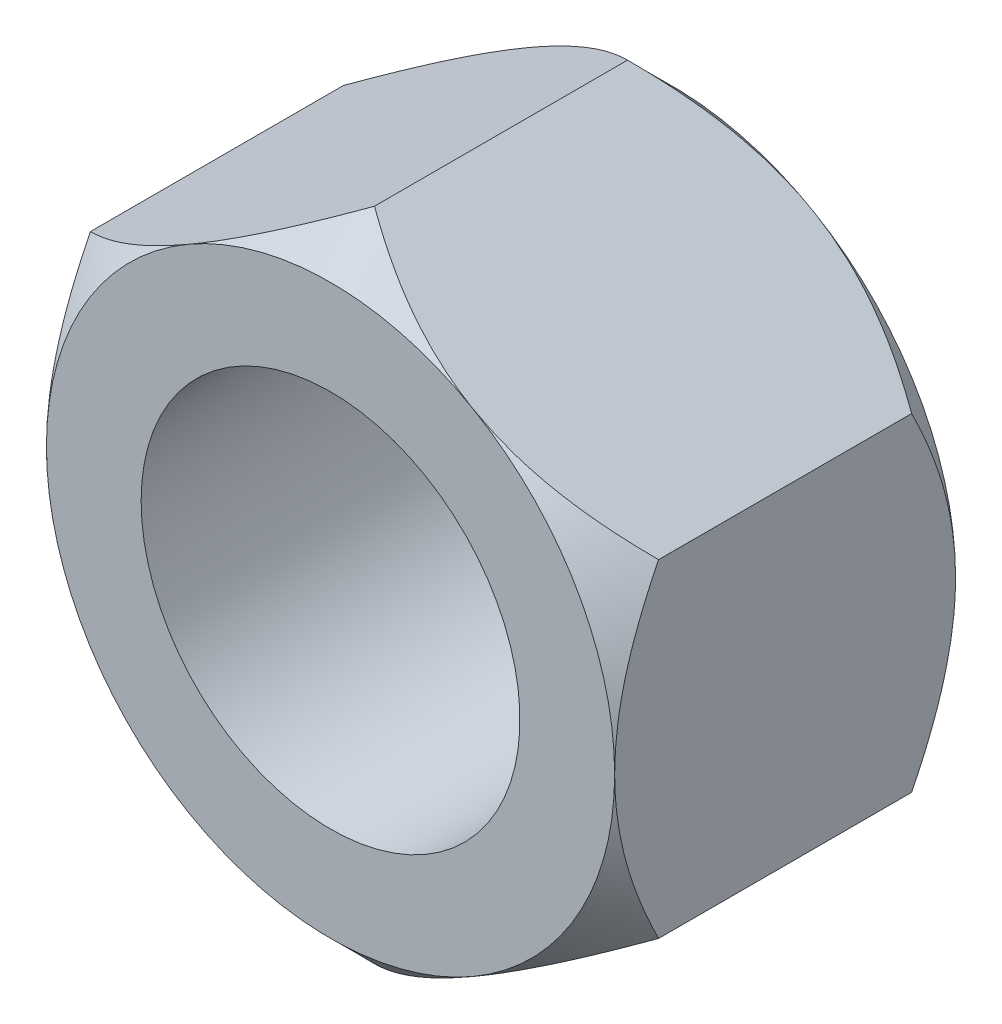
ISO-10303-21;
HEADER;
FILE_DESCRIPTION(('STEP AP214'),'2;1');
FILE_NAME('part.step','',(''),(''),'','','');
FILE_SCHEMA(('AUTOMOTIVE_DESIGN { 1 0 10303 214 1 1 1 1 }'));
ENDSEC;
DATA;
#1=APPLICATION_CONTEXT('core data for automotive mechanical design processes');
#2=APPLICATION_PROTOCOL_DEFINITION('international standard','automotive_design',2000,#1);
#3=PRODUCT_CONTEXT('',#1,'mechanical');
#4=PRODUCT('Part','Part','',(#3));
#5=PRODUCT_RELATED_PRODUCT_CATEGORY('part','',(#4));
#6=PRODUCT_DEFINITION_FORMATION('','',#4);
#7=PRODUCT_DEFINITION_CONTEXT('part definition',#1,'design');
#8=PRODUCT_DEFINITION('design','',#6,#7);
#9=PRODUCT_DEFINITION_SHAPE('','',#8);
#10=(LENGTH_UNIT() NAMED_UNIT(*) SI_UNIT(.MILLI.,.METRE.));
#11=(NAMED_UNIT(*) PLANE_ANGLE_UNIT() SI_UNIT($,.RADIAN.));
#12=(NAMED_UNIT(*) SI_UNIT($,.STERADIAN.) SOLID_ANGLE_UNIT());
#13=UNCERTAINTY_MEASURE_WITH_UNIT(LENGTH_MEASURE(1.E-05),#10,'distance_accuracy_value','');
#14=(GEOMETRIC_REPRESENTATION_CONTEXT(3) GLOBAL_UNCERTAINTY_ASSIGNED_CONTEXT((#13)) GLOBAL_UNIT_ASSIGNED_CONTEXT((#10,
#11,#12)) REPRESENTATION_CONTEXT('',''));
#15=CARTESIAN_POINT('',(0.,0.,0.));
#16=DIRECTION('',(0.,0.,1.));
#17=DIRECTION('',(1.,0.,0.));
#18=AXIS2_PLACEMENT_3D('',#15,#16,#17);
#19=CARTESIAN_POINT('',(0.,10.3923048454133,10.8));
#20=DIRECTION('',(0.5,-0.866025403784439,0.));
#21=DIRECTION('',(0.866025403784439,0.5,0.));
#22=AXIS2_PLACEMENT_3D('',#19,#20,#21);
#23=PLANE('',#22);
#24=DIRECTION('',(0.,0.,-1.));
#25=VECTOR('',#24,1.);
#26=CARTESIAN_POINT('',(0.,10.3923048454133,10.8));
#27=LINE('',#26,#25);
#28=CARTESIAN_POINT('',(0.,10.3923048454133,9.40769515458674));
#29=VERTEX_POINT('',#28);
#30=CARTESIAN_POINT('',(0.,10.3923048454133,1.39230484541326));
#31=VERTEX_POINT('',#30);
#32=EDGE_CURVE('E199',#29,#31,#27,.T.);
#33=ORIENTED_EDGE('',*,*,#32,.T.);
#34=CARTESIAN_POINT('',(0.000200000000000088,10.3924203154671,1.39242031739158));
#35=CARTESIAN_POINT('',(-0.154531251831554,10.3030861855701,1.30309863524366));
#36=CARTESIAN_POINT('',(-0.310474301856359,10.21305242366,1.21650254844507));
#37=CARTESIAN_POINT('',(-0.624972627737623,10.0314767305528,1.04962736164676));
#38=CARTESIAN_POINT('',(-0.783529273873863,9.93993400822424,0.969351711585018));
#39=CARTESIAN_POINT('',(-1.10419129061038,9.75479970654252,0.815643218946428));
#40=CARTESIAN_POINT('',(-1.26631178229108,9.66119939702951,0.742252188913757));
#41=CARTESIAN_POINT('',(-1.59321555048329,9.47246141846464,0.603906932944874));
#42=CARTESIAN_POINT('',(-1.7579984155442,9.37732398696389,0.538951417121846));
#43=CARTESIAN_POINT('',(-2.08757746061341,9.18704143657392,0.419532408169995));
#44=CARTESIAN_POINT('',(-2.25233313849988,9.09191970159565,0.364920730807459));
#45=CARTESIAN_POINT('',(-2.58415409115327,8.90034278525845,0.266051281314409));
#46=CARTESIAN_POINT('',(-2.75121911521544,8.80388774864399,0.221792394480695));
#47=CARTESIAN_POINT('',(-3.08694416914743,8.61005679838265,0.144742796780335));
#48=CARTESIAN_POINT('',(-3.25559971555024,8.51268347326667,0.111926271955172));
#49=CARTESIAN_POINT('',(-3.59432673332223,8.31711933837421,0.0584825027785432));
#50=CARTESIAN_POINT('',(-3.76439798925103,8.2189286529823,0.0378534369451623));
#51=CARTESIAN_POINT('',(-4.17884614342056,7.97964689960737,0.00326438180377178));
#52=CARTESIAN_POINT('',(-4.42367100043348,7.83829720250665,-0.00399417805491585));
#53=CARTESIAN_POINT('',(-4.91287794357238,7.55585344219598,0.00818869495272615));
#54=CARTESIAN_POINT('',(-5.15725984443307,7.41475948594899,0.0276394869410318));
#55=CARTESIAN_POINT('',(-5.64371998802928,7.13390159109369,0.0920929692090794));
#56=CARTESIAN_POINT('',(-5.88579534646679,6.99413931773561,0.137124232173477));
#57=CARTESIAN_POINT('',(-6.36578525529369,6.7170170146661,0.250290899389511));
#58=CARTESIAN_POINT('',(-6.60370012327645,6.57965680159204,0.31842453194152));
#59=CARTESIAN_POINT('',(-7.02603245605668,6.33582311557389,0.458593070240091));
#60=CARTESIAN_POINT('',(-7.21138526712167,6.22880962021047,0.526940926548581));
#61=CARTESIAN_POINT('',(-7.57876374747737,6.01670355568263,0.674650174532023));
#62=CARTESIAN_POINT('',(-7.76078931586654,5.91161104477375,0.754011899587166));
#63=CARTESIAN_POINT('',(-8.12093998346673,5.70367795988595,0.921970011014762));
#64=CARTESIAN_POINT('',(-8.29907532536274,5.6008314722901,1.01053735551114));
#65=CARTESIAN_POINT('',(-8.65204760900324,5.39704282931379,1.19574403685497));
#66=CARTESIAN_POINT('',(-8.82688649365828,5.29609955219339,1.2923784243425));
#67=CARTESIAN_POINT('',(-9.0002,5.1960369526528,1.39242031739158));
#68=B_SPLINE_CURVE_WITH_KNOTS('',3,(#34,#35,#36,#37,#38,#39,#40,#41,#42,#43,#44,#45,#46,#47,#48,
#49,#50,#51,#52,#53,#54,#55,#56,#57,#58,#59,#60,#61,#62,#63,#64,#65,#66,#67),.UNSPECIFIED.,.F.,
.F.,(4,2,2,2,2,2,2,2,2,2,2,2,2,2,2,2,4),(0.,0.59928023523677,1.19888534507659,1.80192368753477,
2.40486970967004,2.99838724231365,3.59184084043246,4.18394681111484,4.77596426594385,
5.62301971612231,6.47037205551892,7.31867273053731,8.16690836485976,8.84061799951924,
9.5143480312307,10.1860136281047,10.8572701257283),.UNSPECIFIED.);
#69=CARTESIAN_POINT('',(-4.5,7.79422863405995,0.));
#70=VERTEX_POINT('',#69);
#71=EDGE_CURVE('E48',#31,#70,#68,.T.);
#72=ORIENTED_EDGE('',*,*,#71,.T.);
#73=CARTESIAN_POINT('',(-9.,5.19615242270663,1.39230484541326));
#74=VERTEX_POINT('',#73);
#75=EDGE_CURVE('E143',#70,#74,#68,.T.);
#76=ORIENTED_EDGE('',*,*,#75,.T.);
#77=DIRECTION('',(0.,0.,-1.));
#78=VECTOR('',#77,1.);
#79=CARTESIAN_POINT('',(-9.,5.19615242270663,10.8));
#80=LINE('',#79,#78);
#81=CARTESIAN_POINT('',(-9.,5.19615242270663,9.40769515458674));
#82=VERTEX_POINT('',#81);
#83=EDGE_CURVE('E154',#82,#74,#80,.T.);
#84=ORIENTED_EDGE('',*,*,#83,.F.);
#85=CARTESIAN_POINT('',(0.0002,10.3924203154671,9.40757968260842));
#86=CARTESIAN_POINT('',(-0.154531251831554,10.3030861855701,9.49690136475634));
#87=CARTESIAN_POINT('',(-0.310474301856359,10.21305242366,9.58349745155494));
#88=CARTESIAN_POINT('',(-0.624972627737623,10.0314767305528,9.75037263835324));
#89=CARTESIAN_POINT('',(-0.783529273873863,9.93993400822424,9.83064828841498));
#90=CARTESIAN_POINT('',(-1.10419129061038,9.75479970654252,9.98435678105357));
#91=CARTESIAN_POINT('',(-1.26631178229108,9.66119939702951,10.0577478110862));
#92=CARTESIAN_POINT('',(-1.59321555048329,9.47246141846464,10.1960930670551));
#93=CARTESIAN_POINT('',(-1.7579984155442,9.37732398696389,10.2610485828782));
#94=CARTESIAN_POINT('',(-2.08757746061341,9.18704143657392,10.38046759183));
#95=CARTESIAN_POINT('',(-2.25233313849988,9.09191970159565,10.4350792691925));
#96=CARTESIAN_POINT('',(-2.58415409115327,8.90034278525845,10.5339487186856));
#97=CARTESIAN_POINT('',(-2.75121911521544,8.80388774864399,10.5782076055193));
#98=CARTESIAN_POINT('',(-3.08694416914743,8.61005679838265,10.6552572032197));
#99=CARTESIAN_POINT('',(-3.25559971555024,8.51268347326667,10.6880737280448));
#100=CARTESIAN_POINT('',(-3.59432673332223,8.31711933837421,10.7415174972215));
#101=CARTESIAN_POINT('',(-3.76439798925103,8.2189286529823,10.7621465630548));
#102=CARTESIAN_POINT('',(-4.17884614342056,7.97964689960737,10.7967356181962));
#103=CARTESIAN_POINT('',(-4.42367100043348,7.83829720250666,10.8039941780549));
#104=CARTESIAN_POINT('',(-4.91287794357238,7.55585344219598,10.7918113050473));
#105=CARTESIAN_POINT('',(-5.15725984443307,7.41475948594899,10.772360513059));
#106=CARTESIAN_POINT('',(-5.64371998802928,7.13390159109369,10.7079070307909));
#107=CARTESIAN_POINT('',(-5.8857953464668,6.99413931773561,10.6628757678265));
#108=CARTESIAN_POINT('',(-6.36578525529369,6.7170170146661,10.5497091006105));
#109=CARTESIAN_POINT('',(-6.60370012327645,6.57965680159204,10.4815754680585));
#110=CARTESIAN_POINT('',(-7.02603245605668,6.33582311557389,10.3414069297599));
#111=CARTESIAN_POINT('',(-7.21138526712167,6.22880962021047,10.2730590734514));
#112=CARTESIAN_POINT('',(-7.57876374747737,6.01670355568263,10.125349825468));
#113=CARTESIAN_POINT('',(-7.76078931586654,5.91161104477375,10.0459881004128));
#114=CARTESIAN_POINT('',(-8.12093998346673,5.70367795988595,9.87802998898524));
#115=CARTESIAN_POINT('',(-8.29907532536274,5.6008314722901,9.78946264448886));
#116=CARTESIAN_POINT('',(-8.65204760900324,5.39704282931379,9.60425596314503));
#117=CARTESIAN_POINT('',(-8.82688649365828,5.29609955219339,9.5076215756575));
#118=CARTESIAN_POINT('',(-9.0002,5.1960369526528,9.40757968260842));
#119=B_SPLINE_CURVE_WITH_KNOTS('',3,(#85,#86,#87,#88,#89,#90,#91,#92,#93,#94,#95,#96,#97,#98,
#99,#100,#101,#102,#103,#104,#105,#106,#107,#108,#109,#110,#111,#112,#113,#114,#115,#116,#117,
#118),.UNSPECIFIED.,.F.,.F.,(4,2,2,2,2,2,2,2,2,2,2,2,2,2,2,2,4),(0.,0.59928023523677,
1.19888534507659,1.80192368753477,2.40486970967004,2.99838724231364,3.59184084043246,
4.18394681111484,4.77596426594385,5.62301971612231,6.47037205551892,7.31867273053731,
8.16690836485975,8.84061799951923,9.5143480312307,10.1860136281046,10.8572701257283),.UNSPECIFIED.);
#120=CARTESIAN_POINT('',(-4.5,7.79422863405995,10.8));
#121=VERTEX_POINT('',#120);
#122=EDGE_CURVE('E240',#121,#82,#119,.T.);
#123=ORIENTED_EDGE('',*,*,#122,.F.);
#124=EDGE_CURVE('E229',#29,#121,#119,.T.);
#125=ORIENTED_EDGE('',*,*,#124,.F.);
#126=EDGE_LOOP('',(#33,#72,#76,#84,#123,#125));
#127=FACE_BOUND('',#126,.T.);
#128=ADVANCED_FACE('F32',(#127),#23,.F.);
#129=CARTESIAN_POINT('',(-9.,5.19615242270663,10.8));
#130=DIRECTION('',(1.,0.,0.));
#131=DIRECTION('',(0.,0.,-1.));
#132=AXIS2_PLACEMENT_3D('',#129,#130,#131);
#133=PLANE('',#132);
#134=ORIENTED_EDGE('',*,*,#83,.T.);
#135=CARTESIAN_POINT('',(-9.,-12.9425127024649,6.76415665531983));
#136=CARTESIAN_POINT('',(-9.,-12.7796187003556,6.63042170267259));
#137=CARTESIAN_POINT('',(-9.,-12.6163238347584,6.49717524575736));
#138=CARTESIAN_POINT('',(-9.,-12.2888524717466,6.23176562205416));
#139=CARTESIAN_POINT('',(-9.,-12.1246759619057,6.09960247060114));
#140=CARTESIAN_POINT('',(-9.,-11.6306315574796,5.70483957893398));
#141=CARTESIAN_POINT('',(-9.,-11.2993273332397,5.4440310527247));
#142=CARTESIAN_POINT('',(-9.,-10.6284830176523,4.92547477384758));
#143=CARTESIAN_POINT('',(-9.,-10.2888924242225,4.6677922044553));
#144=CARTESIAN_POINT('',(-9.,-9.6041128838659,4.16002284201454));
#145=CARTESIAN_POINT('',(-9.,-9.25892448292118,3.9099353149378));
#146=CARTESIAN_POINT('',(-9.,-8.5289906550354,3.39637540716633));
#147=CARTESIAN_POINT('',(-9.,-8.14357441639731,3.13385125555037));
#148=CARTESIAN_POINT('',(-9.,-7.3625102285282,2.62406660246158));
#149=CARTESIAN_POINT('',(-9.,-6.966858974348,2.3768111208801));
#150=CARTESIAN_POINT('',(-9.,-6.16502652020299,1.90426639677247));
#151=CARTESIAN_POINT('',(-9.,-5.75890273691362,1.67888049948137));
#152=CARTESIAN_POINT('',(-9.,-4.93213782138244,1.25669563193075));
#153=CARTESIAN_POINT('',(-9.,-4.51150970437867,1.05987181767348));
#154=CARTESIAN_POINT('',(-9.,-3.93031280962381,0.819784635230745));
#155=CARTESIAN_POINT('',(-9.,-3.77681639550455,0.759294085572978));
#156=CARTESIAN_POINT('',(-9.,-3.4677439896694,0.643892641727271));
#157=CARTESIAN_POINT('',(-9.,-3.31216801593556,0.588981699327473));
#158=CARTESIAN_POINT('',(-9.,-2.84228416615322,0.433518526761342));
#159=CARTESIAN_POINT('',(-9.,-2.52481368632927,0.34223314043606));
#160=CARTESIAN_POINT('',(-9.,-1.8898383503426,0.191225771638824));
#161=CARTESIAN_POINT('',(-9.,-1.57249215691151,0.130845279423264));
#162=CARTESIAN_POINT('',(-9.,-0.933261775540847,0.0427290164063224));
#163=CARTESIAN_POINT('',(-9.,-0.611378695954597,0.0149854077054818));
#164=CARTESIAN_POINT('',(-9.,0.0166148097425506,-0.00516966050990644));
#165=CARTESIAN_POINT('',(-9.,0.322668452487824,0.000644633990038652));
#166=CARTESIAN_POINT('',(-9.,0.9326145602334,0.0430727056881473));
#167=CARTESIAN_POINT('',(-9.,1.23650687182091,0.0796886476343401));
#168=CARTESIAN_POINT('',(-9.,1.84523796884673,0.182214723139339));
#169=CARTESIAN_POINT('',(-9.,2.14998238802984,0.248675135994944));
#170=CARTESIAN_POINT('',(-9.,2.75266288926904,0.407045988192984));
#171=CARTESIAN_POINT('',(-9.,3.05059909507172,0.498955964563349));
#172=CARTESIAN_POINT('',(-9.,3.64630905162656,0.706473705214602));
#173=CARTESIAN_POINT('',(-9.,3.94389528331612,0.822612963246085));
#174=CARTESIAN_POINT('',(-9.,4.53146042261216,1.07290548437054));
#175=CARTESIAN_POINT('',(-9.,4.82143592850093,1.20706664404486));
#176=CARTESIAN_POINT('',(-9.,5.39511274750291,1.49022463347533));
#177=CARTESIAN_POINT('',(-9.,5.67879175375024,1.63926628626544));
#178=CARTESIAN_POINT('',(-9.,6.23966754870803,1.94891733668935));
#179=CARTESIAN_POINT('',(-9.,6.51686530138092,2.10952499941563));
#180=CARTESIAN_POINT('',(-9.,7.05205106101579,2.43188959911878));
#181=CARTESIAN_POINT('',(-9.,7.31031122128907,2.5931971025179));
#182=CARTESIAN_POINT('',(-9.,7.82239380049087,2.92272859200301));
#183=CARTESIAN_POINT('',(-9.,8.07621588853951,3.09095309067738));
#184=CARTESIAN_POINT('',(-9.,8.57797886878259,3.43173440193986));
#185=CARTESIAN_POINT('',(-9.,8.82595046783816,3.60424616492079));
#186=CARTESIAN_POINT('',(-9.,9.31848463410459,3.95393305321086));
#187=CARTESIAN_POINT('',(-9.,9.56304812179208,4.13110688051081));
#188=CARTESIAN_POINT('',(-9.,9.80618026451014,4.3101905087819));
#189=B_SPLINE_CURVE_WITH_KNOTS('',3,(#135,#136,#137,#138,#139,#140,#141,#142,#143,#144,#145,
#146,#147,#148,#149,#150,#151,#152,#153,#154,#155,#156,#157,#158,#159,#160,#161,#162,#163,#164,
#165,#166,#167,#168,#169,#170,#171,#172,#173,#174,#175,#176,#177,#178,#179,#180,#181,#182,#183,
#184,#185,#186,#187,#188),.UNSPECIFIED.,.F.,.F.,(4,2,2,2,2,2,2,2,2,2,2,2,2,2,2,2,2,2,2,2,2,2,2,
2,2,2,4),(0.,0.632276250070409,1.26456143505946,2.52943697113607,3.80821994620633,
5.08687893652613,6.48560372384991,7.8847859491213,9.27747207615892,10.6689394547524,
11.1638034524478,11.6586631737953,12.6483609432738,13.6159869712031,14.5833805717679,
15.5001120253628,16.4169079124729,17.3513499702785,18.2857750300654,19.2433893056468,
20.2014245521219,21.1624380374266,22.1233076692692,23.0366697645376,23.9500996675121,
24.8562709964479,25.7621926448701),.UNSPECIFIED.);
#190=CARTESIAN_POINT('',(-9.,0.,0.));
#191=VERTEX_POINT('',#190);
#192=EDGE_CURVE('E137',#74,#191,#189,.F.);
#193=ORIENTED_EDGE('',*,*,#192,.T.);
#194=CARTESIAN_POINT('',(-9.,-5.19615242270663,1.39230484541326));
#195=VERTEX_POINT('',#194);
#196=EDGE_CURVE('E125',#191,#195,#189,.F.);
#197=ORIENTED_EDGE('',*,*,#196,.T.);
#198=DIRECTION('',(0.,0.,-1.));
#199=VECTOR('',#198,1.);
#200=CARTESIAN_POINT('',(-9.,-5.19615242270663,10.8));
#201=LINE('',#200,#199);
#202=CARTESIAN_POINT('',(-9.,-5.19615242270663,9.40769515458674));
#203=VERTEX_POINT('',#202);
#204=EDGE_CURVE('E321',#203,#195,#201,.T.);
#205=ORIENTED_EDGE('',*,*,#204,.F.);
#206=CARTESIAN_POINT('',(-9.,-12.9425127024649,4.03584334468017));
#207=CARTESIAN_POINT('',(-9.,-12.7796187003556,4.16957829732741));
#208=CARTESIAN_POINT('',(-9.,-12.6163238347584,4.30282475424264));
#209=CARTESIAN_POINT('',(-9.,-12.2888524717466,4.56823437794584));
#210=CARTESIAN_POINT('',(-9.,-12.1246759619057,4.70039752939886));
#211=CARTESIAN_POINT('',(-9.,-11.6306315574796,5.09516042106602));
#212=CARTESIAN_POINT('',(-9.,-11.2993273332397,5.3559689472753));
#213=CARTESIAN_POINT('',(-9.,-10.6284830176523,5.87452522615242));
#214=CARTESIAN_POINT('',(-9.,-10.2888924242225,6.1322077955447));
#215=CARTESIAN_POINT('',(-9.,-9.60411288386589,6.63997715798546));
#216=CARTESIAN_POINT('',(-9.,-9.25892448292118,6.8900646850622));
#217=CARTESIAN_POINT('',(-9.,-8.5289906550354,7.40362459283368));
#218=CARTESIAN_POINT('',(-9.,-8.14357441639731,7.66614874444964));
#219=CARTESIAN_POINT('',(-9.,-7.3625102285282,8.17593339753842));
#220=CARTESIAN_POINT('',(-9.,-6.966858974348,8.42318887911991));
#221=CARTESIAN_POINT('',(-9.,-6.16502652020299,8.89573360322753));
#222=CARTESIAN_POINT('',(-9.,-5.75890273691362,9.12111950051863));
#223=CARTESIAN_POINT('',(-9.,-4.93213782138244,9.54330436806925));
#224=CARTESIAN_POINT('',(-9.,-4.51150970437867,9.74012818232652));
#225=CARTESIAN_POINT('',(-9.,-3.93031280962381,9.98021536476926));
#226=CARTESIAN_POINT('',(-9.,-3.77681639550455,10.040705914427));
#227=CARTESIAN_POINT('',(-9.,-3.4677439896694,10.1561073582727));
#228=CARTESIAN_POINT('',(-9.,-3.31216801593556,10.2110183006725));
#229=CARTESIAN_POINT('',(-9.,-2.84228416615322,10.3664814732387));
#230=CARTESIAN_POINT('',(-9.,-2.52481368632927,10.4577668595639));
#231=CARTESIAN_POINT('',(-9.,-1.8898383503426,10.6087742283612));
#232=CARTESIAN_POINT('',(-9.,-1.57249215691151,10.6691547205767));
#233=CARTESIAN_POINT('',(-9.,-0.933261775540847,10.7572709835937));
#234=CARTESIAN_POINT('',(-9.,-0.611378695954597,10.7850145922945));
#235=CARTESIAN_POINT('',(-9.,0.0166148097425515,10.8051696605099));
#236=CARTESIAN_POINT('',(-9.,0.322668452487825,10.79935536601));
#237=CARTESIAN_POINT('',(-9.,0.932614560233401,10.7569272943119));
#238=CARTESIAN_POINT('',(-9.,1.23650687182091,10.7203113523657));
#239=CARTESIAN_POINT('',(-9.,1.84523796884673,10.6177852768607));
#240=CARTESIAN_POINT('',(-9.,2.14998238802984,10.5513248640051));
#241=CARTESIAN_POINT('',(-9.,2.75266288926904,10.392954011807));
#242=CARTESIAN_POINT('',(-9.,3.05059909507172,10.3010440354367));
#243=CARTESIAN_POINT('',(-9.,3.64630905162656,10.0935262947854));
#244=CARTESIAN_POINT('',(-9.,3.94389528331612,9.97738703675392));
#245=CARTESIAN_POINT('',(-9.,4.53146042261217,9.72709451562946));
#246=CARTESIAN_POINT('',(-9.,4.82143592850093,9.59293335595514));
#247=CARTESIAN_POINT('',(-9.,5.39511274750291,9.30977536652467));
#248=CARTESIAN_POINT('',(-9.,5.67879175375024,9.16073371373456));
#249=CARTESIAN_POINT('',(-9.,6.23966754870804,8.85108266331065));
#250=CARTESIAN_POINT('',(-9.,6.51686530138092,8.69047500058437));
#251=CARTESIAN_POINT('',(-9.,7.05205106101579,8.36811040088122));
#252=CARTESIAN_POINT('',(-9.,7.31031122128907,8.2068028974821));
#253=CARTESIAN_POINT('',(-9.,7.82239380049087,7.877271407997));
#254=CARTESIAN_POINT('',(-9.,8.07621588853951,7.70904690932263));
#255=CARTESIAN_POINT('',(-9.,8.57797886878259,7.36826559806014));
#256=CARTESIAN_POINT('',(-9.,8.82595046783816,7.19575383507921));
#257=CARTESIAN_POINT('',(-9.,9.31848463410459,6.84606694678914));
#258=CARTESIAN_POINT('',(-9.,9.56304812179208,6.66889311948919));
#259=CARTESIAN_POINT('',(-9.,9.80618026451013,6.48980949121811));
#260=B_SPLINE_CURVE_WITH_KNOTS('',3,(#206,#207,#208,#209,#210,#211,#212,#213,#214,#215,#216,
#217,#218,#219,#220,#221,#222,#223,#224,#225,#226,#227,#228,#229,#230,#231,#232,#233,#234,#235,
#236,#237,#238,#239,#240,#241,#242,#243,#244,#245,#246,#247,#248,#249,#250,#251,#252,#253,#254,
#255,#256,#257,#258,#259),.UNSPECIFIED.,.F.,.F.,(4,2,2,2,2,2,2,2,2,2,2,2,2,2,2,2,2,2,2,2,2,2,2,
2,2,2,4),(0.,0.632276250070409,1.26456143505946,2.52943697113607,3.80821994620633,
5.08687893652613,6.48560372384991,7.8847859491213,9.27747207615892,10.6689394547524,
11.1638034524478,11.6586631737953,12.6483609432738,13.6159869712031,14.5833805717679,
15.5001120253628,16.4169079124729,17.3513499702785,18.2857750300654,19.2433893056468,
20.2014245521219,21.1624380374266,22.1233076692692,23.0366697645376,23.9500996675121,
24.8562709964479,25.7621926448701),.UNSPECIFIED.);
#261=CARTESIAN_POINT('',(-9.,0.,10.8));
#262=VERTEX_POINT('',#261);
#263=EDGE_CURVE('E184',#262,#203,#260,.F.);
#264=ORIENTED_EDGE('',*,*,#263,.F.);
#265=EDGE_CURVE('E191',#82,#262,#260,.F.);
#266=ORIENTED_EDGE('',*,*,#265,.F.);
#267=EDGE_LOOP('',(#134,#193,#197,#205,#264,#266));
#268=FACE_BOUND('',#267,.T.);
#269=ADVANCED_FACE('F151',(#268),#133,.F.);
#270=CARTESIAN_POINT('',(-9.,-5.19615242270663,10.8));
#271=DIRECTION('',(0.5,0.866025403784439,0.));
#272=DIRECTION('',(-0.866025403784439,0.5,0.));
#273=AXIS2_PLACEMENT_3D('',#270,#271,#272);
#274=PLANE('',#273);
#275=ORIENTED_EDGE('',*,*,#204,.T.);
#276=CARTESIAN_POINT('',(-9.0002,-5.19603695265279,1.39242031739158));
#277=CARTESIAN_POINT('',(-8.84546874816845,-5.28537108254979,1.30309863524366));
#278=CARTESIAN_POINT('',(-8.68952569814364,-5.37540484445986,1.21650254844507));
#279=CARTESIAN_POINT('',(-8.37502737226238,-5.5569805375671,1.04962736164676));
#280=CARTESIAN_POINT('',(-8.21647072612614,-5.64852325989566,0.969351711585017));
#281=CARTESIAN_POINT('',(-7.89580870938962,-5.83365756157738,0.815643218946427));
#282=CARTESIAN_POINT('',(-7.73368821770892,-5.92725787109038,0.742252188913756));
#283=CARTESIAN_POINT('',(-7.40678444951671,-6.11599584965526,0.603906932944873));
#284=CARTESIAN_POINT('',(-7.2420015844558,-6.21113328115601,0.538951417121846));
#285=CARTESIAN_POINT('',(-6.91242253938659,-6.40141583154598,0.419532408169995));
#286=CARTESIAN_POINT('',(-6.74766686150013,-6.49653756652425,0.364920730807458));
#287=CARTESIAN_POINT('',(-6.41584590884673,-6.68811448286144,0.26605128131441));
#288=CARTESIAN_POINT('',(-6.24878088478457,-6.78456951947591,0.221792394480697));
#289=CARTESIAN_POINT('',(-5.91305583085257,-6.97840046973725,0.144742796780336));
#290=CARTESIAN_POINT('',(-5.74440028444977,-7.07577379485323,0.111926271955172));
#291=CARTESIAN_POINT('',(-5.40567326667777,-7.27133792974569,0.0584825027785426));
#292=CARTESIAN_POINT('',(-5.23560201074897,-7.3695286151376,0.0378534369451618));
#293=CARTESIAN_POINT('',(-4.82115385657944,-7.60881036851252,0.00326438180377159));
#294=CARTESIAN_POINT('',(-4.57632899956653,-7.75016006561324,-0.0039941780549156));
#295=CARTESIAN_POINT('',(-4.08712205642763,-8.03260382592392,0.00818869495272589));
#296=CARTESIAN_POINT('',(-3.84274015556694,-8.17369778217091,0.0276394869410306));
#297=CARTESIAN_POINT('',(-3.35628001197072,-8.45455567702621,0.0920929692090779));
#298=CARTESIAN_POINT('',(-3.11420465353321,-8.59431795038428,0.137124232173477));
#299=CARTESIAN_POINT('',(-2.63421474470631,-8.87144025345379,0.250290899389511));
#300=CARTESIAN_POINT('',(-2.39629987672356,-9.00880046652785,0.318424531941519));
#301=CARTESIAN_POINT('',(-1.97396754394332,-9.252634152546,0.458593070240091));
#302=CARTESIAN_POINT('',(-1.78861473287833,-9.35964764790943,0.526940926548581));
#303=CARTESIAN_POINT('',(-1.42123625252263,-9.57175371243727,0.674650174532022));
#304=CARTESIAN_POINT('',(-1.23921068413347,-9.67684622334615,0.754011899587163));
#305=CARTESIAN_POINT('',(-0.87906001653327,-9.88477930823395,0.921970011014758));
#306=CARTESIAN_POINT('',(-0.700924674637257,-9.98762579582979,1.01053735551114));
#307=CARTESIAN_POINT('',(-0.34795239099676,-10.1914144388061,1.19574403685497));
#308=CARTESIAN_POINT('',(-0.173113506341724,-10.2923577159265,1.2923784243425));
#309=CARTESIAN_POINT('',(0.000199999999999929,-10.3924203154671,1.39242031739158));
#310=B_SPLINE_CURVE_WITH_KNOTS('',3,(#276,#277,#278,#279,#280,#281,#282,#283,#284,#285,#286,
#287,#288,#289,#290,#291,#292,#293,#294,#295,#296,#297,#298,#299,#300,#301,#302,#303,#304,#305,
#306,#307,#308,#309),.UNSPECIFIED.,.F.,.F.,(4,2,2,2,2,2,2,2,2,2,2,2,2,2,2,2,4),(0.,
0.599280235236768,1.19888534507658,1.80192368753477,2.40486970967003,2.99838724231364,
3.59184084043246,4.18394681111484,4.77596426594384,5.6230197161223,6.47037205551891,
7.3186727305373,8.16690836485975,8.84061799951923,9.5143480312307,10.1860136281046,
10.8572701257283),.UNSPECIFIED.);
#311=CARTESIAN_POINT('',(-4.5,-7.79422863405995,0.));
#312=VERTEX_POINT('',#311);
#313=EDGE_CURVE('E132',#195,#312,#310,.T.);
#314=ORIENTED_EDGE('',*,*,#313,.T.);
#315=CARTESIAN_POINT('',(0.,-10.3923048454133,1.39230484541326));
#316=VERTEX_POINT('',#315);
#317=EDGE_CURVE('E165',#312,#316,#310,.T.);
#318=ORIENTED_EDGE('',*,*,#317,.T.);
#319=DIRECTION('',(0.,0.,-1.));
#320=VECTOR('',#319,1.);
#321=CARTESIAN_POINT('',(0.,-10.3923048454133,10.8));
#322=LINE('',#321,#320);
#323=CARTESIAN_POINT('',(0.,-10.3923048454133,9.40769515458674));
#324=VERTEX_POINT('',#323);
#325=EDGE_CURVE('E322',#324,#316,#322,.T.);
#326=ORIENTED_EDGE('',*,*,#325,.F.);
#327=CARTESIAN_POINT('',(-9.0002,-5.19603695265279,9.40757968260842));
#328=CARTESIAN_POINT('',(-8.84546874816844,-5.28537108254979,9.49690136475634));
#329=CARTESIAN_POINT('',(-8.68952569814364,-5.37540484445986,9.58349745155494));
#330=CARTESIAN_POINT('',(-8.37502737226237,-5.5569805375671,9.75037263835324));
#331=CARTESIAN_POINT('',(-8.21647072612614,-5.64852325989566,9.83064828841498));
#332=CARTESIAN_POINT('',(-7.89580870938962,-5.83365756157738,9.98435678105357));
#333=CARTESIAN_POINT('',(-7.73368821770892,-5.92725787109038,10.0577478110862));
#334=CARTESIAN_POINT('',(-7.40678444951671,-6.11599584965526,10.1960930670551));
#335=CARTESIAN_POINT('',(-7.2420015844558,-6.21113328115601,10.2610485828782));
#336=CARTESIAN_POINT('',(-6.91242253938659,-6.40141583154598,10.38046759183));
#337=CARTESIAN_POINT('',(-6.74766686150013,-6.49653756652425,10.4350792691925));
#338=CARTESIAN_POINT('',(-6.41584590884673,-6.68811448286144,10.5339487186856));
#339=CARTESIAN_POINT('',(-6.24878088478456,-6.78456951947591,10.5782076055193));
#340=CARTESIAN_POINT('',(-5.91305583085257,-6.97840046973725,10.6552572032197));
#341=CARTESIAN_POINT('',(-5.74440028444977,-7.07577379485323,10.6880737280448));
#342=CARTESIAN_POINT('',(-5.40567326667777,-7.27133792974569,10.7415174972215));
#343=CARTESIAN_POINT('',(-5.23560201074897,-7.3695286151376,10.7621465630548));
#344=CARTESIAN_POINT('',(-4.82115385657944,-7.60881036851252,10.7967356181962));
#345=CARTESIAN_POINT('',(-4.57632899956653,-7.75016006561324,10.8039941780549));
#346=CARTESIAN_POINT('',(-4.08712205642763,-8.03260382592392,10.7918113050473));
#347=CARTESIAN_POINT('',(-3.84274015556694,-8.17369778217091,10.772360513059));
#348=CARTESIAN_POINT('',(-3.35628001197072,-8.45455567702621,10.7079070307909));
#349=CARTESIAN_POINT('',(-3.11420465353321,-8.59431795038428,10.6628757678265));
#350=CARTESIAN_POINT('',(-2.63421474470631,-8.87144025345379,10.5497091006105));
#351=CARTESIAN_POINT('',(-2.39629987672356,-9.00880046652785,10.4815754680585));
#352=CARTESIAN_POINT('',(-1.97396754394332,-9.252634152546,10.3414069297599));
#353=CARTESIAN_POINT('',(-1.78861473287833,-9.35964764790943,10.2730590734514));
#354=CARTESIAN_POINT('',(-1.42123625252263,-9.57175371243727,10.125349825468));
#355=CARTESIAN_POINT('',(-1.23921068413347,-9.67684622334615,10.0459881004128));
#356=CARTESIAN_POINT('',(-0.879060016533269,-9.88477930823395,9.87802998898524));
#357=CARTESIAN_POINT('',(-0.700924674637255,-9.98762579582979,9.78946264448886));
#358=CARTESIAN_POINT('',(-0.347952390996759,-10.1914144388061,9.60425596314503));
#359=CARTESIAN_POINT('',(-0.173113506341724,-10.2923577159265,9.5076215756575));
#360=CARTESIAN_POINT('',(0.000199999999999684,-10.3924203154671,9.40757968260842));
#361=B_SPLINE_CURVE_WITH_KNOTS('',3,(#327,#328,#329,#330,#331,#332,#333,#334,#335,#336,#337,
#338,#339,#340,#341,#342,#343,#344,#345,#346,#347,#348,#349,#350,#351,#352,#353,#354,#355,#356,
#357,#358,#359,#360),.UNSPECIFIED.,.F.,.F.,(4,2,2,2,2,2,2,2,2,2,2,2,2,2,2,2,4),(0.,
0.59928023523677,1.19888534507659,1.80192368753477,2.40486970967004,2.99838724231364,
3.59184084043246,4.18394681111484,4.77596426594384,5.6230197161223,6.47037205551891,
7.3186727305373,8.16690836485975,8.84061799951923,9.5143480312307,10.1860136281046,
10.8572701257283),.UNSPECIFIED.);
#362=CARTESIAN_POINT('',(-4.5,-7.79422863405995,10.8));
#363=VERTEX_POINT('',#362);
#364=EDGE_CURVE('E193',#363,#324,#361,.T.);
#365=ORIENTED_EDGE('',*,*,#364,.F.);
#366=EDGE_CURVE('E192',#203,#363,#361,.T.);
#367=ORIENTED_EDGE('',*,*,#366,.F.);
#368=EDGE_LOOP('',(#275,#314,#318,#326,#365,#367));
#369=FACE_BOUND('',#368,.T.);
#370=ADVANCED_FACE('F179',(#369),#274,.F.);
#371=CARTESIAN_POINT('',(9.,-5.19615242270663,10.8));
#372=DIRECTION('',(0.5,-0.866025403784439,0.));
#373=DIRECTION('',(0.866025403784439,0.5,0.));
#374=AXIS2_PLACEMENT_3D('',#371,#372,#373);
#375=PLANE('',#374);
#376=CARTESIAN_POINT('',(9.0002,-5.19603695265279,1.39242031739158));
#377=CARTESIAN_POINT('',(8.84546874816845,-5.28537108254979,1.30309863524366));
#378=CARTESIAN_POINT('',(8.68952569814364,-5.37540484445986,1.21650254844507));
#379=CARTESIAN_POINT('',(8.37502737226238,-5.5569805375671,1.04962736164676));
#380=CARTESIAN_POINT('',(8.21647072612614,-5.64852325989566,0.969351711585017));
#381=CARTESIAN_POINT('',(7.89580870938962,-5.83365756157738,0.815643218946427));
#382=CARTESIAN_POINT('',(7.73368821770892,-5.92725787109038,0.742252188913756));
#383=CARTESIAN_POINT('',(7.40678444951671,-6.11599584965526,0.603906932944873));
#384=CARTESIAN_POINT('',(7.2420015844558,-6.21113328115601,0.538951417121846));
#385=CARTESIAN_POINT('',(6.91242253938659,-6.40141583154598,0.419532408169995));
#386=CARTESIAN_POINT('',(6.74766686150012,-6.49653756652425,0.364920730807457));
#387=CARTESIAN_POINT('',(6.41584590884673,-6.68811448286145,0.266051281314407));
#388=CARTESIAN_POINT('',(6.24878088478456,-6.78456951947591,0.221792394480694));
#389=CARTESIAN_POINT('',(5.91305583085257,-6.97840046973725,0.144742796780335));
#390=CARTESIAN_POINT('',(5.74440028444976,-7.07577379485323,0.111926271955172));
#391=CARTESIAN_POINT('',(5.40567326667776,-7.27133792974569,0.0584825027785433));
#392=CARTESIAN_POINT('',(5.23560201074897,-7.3695286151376,0.0378534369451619));
#393=CARTESIAN_POINT('',(4.82115385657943,-7.60881036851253,0.00326438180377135));
#394=CARTESIAN_POINT('',(4.57632899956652,-7.75016006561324,-0.00399417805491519));
#395=CARTESIAN_POINT('',(4.08712205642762,-8.03260382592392,0.00818869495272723));
#396=CARTESIAN_POINT('',(3.84274015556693,-8.17369778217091,0.0276394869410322));
#397=CARTESIAN_POINT('',(3.35628001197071,-8.45455567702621,0.0920929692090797));
#398=CARTESIAN_POINT('',(3.1142046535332,-8.59431795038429,0.137124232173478));
#399=CARTESIAN_POINT('',(2.63421474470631,-8.8714402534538,0.250290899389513));
#400=CARTESIAN_POINT('',(2.39629987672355,-9.00880046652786,0.318424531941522));
#401=CARTESIAN_POINT('',(1.97396754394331,-9.25263415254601,0.458593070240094));
#402=CARTESIAN_POINT('',(1.78861473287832,-9.35964764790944,0.526940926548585));
#403=CARTESIAN_POINT('',(1.42123625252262,-9.57175371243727,0.674650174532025));
#404=CARTESIAN_POINT('',(1.23921068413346,-9.67684622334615,0.754011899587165));
#405=CARTESIAN_POINT('',(0.879060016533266,-9.88477930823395,0.92197001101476));
#406=CARTESIAN_POINT('',(0.700924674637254,-9.98762579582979,1.01053735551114));
#407=CARTESIAN_POINT('',(0.34795239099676,-10.1914144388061,1.19574403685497));
#408=CARTESIAN_POINT('',(0.173113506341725,-10.2923577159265,1.2923784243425));
#409=CARTESIAN_POINT('',(-0.000199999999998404,-10.3924203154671,1.39242031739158));
#410=B_SPLINE_CURVE_WITH_KNOTS('',3,(#376,#377,#378,#379,#380,#381,#382,#383,#384,#385,#386,
#387,#388,#389,#390,#391,#392,#393,#394,#395,#396,#397,#398,#399,#400,#401,#402,#403,#404,#405,
#406,#407,#408,#409),.UNSPECIFIED.,.F.,.F.,(4,2,2,2,2,2,2,2,2,2,2,2,2,2,2,2,4),(0.,
0.599280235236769,1.19888534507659,1.80192368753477,2.40486970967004,2.99838724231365,
3.59184084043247,4.18394681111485,4.77596426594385,5.62301971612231,6.47037205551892,
7.31867273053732,8.16690836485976,8.84061799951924,9.51434803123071,10.1860136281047,
10.8572701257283),.UNSPECIFIED.);
#411=CARTESIAN_POINT('',(9.,-5.19615242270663,1.39230484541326));
#412=VERTEX_POINT('',#411);
#413=CARTESIAN_POINT('',(4.5,-7.79422863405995,0.));
#414=VERTEX_POINT('',#413);
#415=EDGE_CURVE('E249',#412,#414,#410,.T.);
#416=ORIENTED_EDGE('',*,*,#415,.F.);
#417=DIRECTION('',(0.,0.,-1.));
#418=VECTOR('',#417,1.);
#419=CARTESIAN_POINT('',(9.,-5.19615242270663,10.8));
#420=LINE('',#419,#418);
#421=CARTESIAN_POINT('',(9.,-5.19615242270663,9.40769515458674));
#422=VERTEX_POINT('',#421);
#423=EDGE_CURVE('E326',#422,#412,#420,.T.);
#424=ORIENTED_EDGE('',*,*,#423,.F.);
#425=CARTESIAN_POINT('',(9.0002,-5.19603695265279,9.40757968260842));
#426=CARTESIAN_POINT('',(8.84546874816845,-5.28537108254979,9.49690136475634));
#427=CARTESIAN_POINT('',(8.68952569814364,-5.37540484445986,9.58349745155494));
#428=CARTESIAN_POINT('',(8.37502737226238,-5.5569805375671,9.75037263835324));
#429=CARTESIAN_POINT('',(8.21647072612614,-5.64852325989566,9.83064828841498));
#430=CARTESIAN_POINT('',(7.89580870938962,-5.83365756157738,9.98435678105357));
#431=CARTESIAN_POINT('',(7.73368821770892,-5.92725787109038,10.0577478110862));
#432=CARTESIAN_POINT('',(7.40678444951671,-6.11599584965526,10.1960930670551));
#433=CARTESIAN_POINT('',(7.2420015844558,-6.21113328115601,10.2610485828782));
#434=CARTESIAN_POINT('',(6.91242253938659,-6.40141583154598,10.38046759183));
#435=CARTESIAN_POINT('',(6.74766686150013,-6.49653756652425,10.4350792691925));
#436=CARTESIAN_POINT('',(6.41584590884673,-6.68811448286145,10.5339487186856));
#437=CARTESIAN_POINT('',(6.24878088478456,-6.78456951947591,10.5782076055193));
#438=CARTESIAN_POINT('',(5.91305583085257,-6.97840046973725,10.6552572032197));
#439=CARTESIAN_POINT('',(5.74440028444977,-7.07577379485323,10.6880737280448));
#440=CARTESIAN_POINT('',(5.40567326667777,-7.27133792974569,10.7415174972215));
#441=CARTESIAN_POINT('',(5.23560201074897,-7.3695286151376,10.7621465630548));
#442=CARTESIAN_POINT('',(4.82115385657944,-7.60881036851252,10.7967356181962));
#443=CARTESIAN_POINT('',(4.57632899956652,-7.75016006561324,10.8039941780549));
#444=CARTESIAN_POINT('',(4.08712205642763,-8.03260382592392,10.7918113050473));
#445=CARTESIAN_POINT('',(3.84274015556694,-8.17369778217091,10.772360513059));
#446=CARTESIAN_POINT('',(3.35628001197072,-8.45455567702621,10.7079070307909));
#447=CARTESIAN_POINT('',(3.11420465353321,-8.59431795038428,10.6628757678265));
#448=CARTESIAN_POINT('',(2.63421474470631,-8.87144025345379,10.5497091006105));
#449=CARTESIAN_POINT('',(2.39629987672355,-9.00880046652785,10.4815754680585));
#450=CARTESIAN_POINT('',(1.97396754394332,-9.252634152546,10.3414069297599));
#451=CARTESIAN_POINT('',(1.78861473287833,-9.35964764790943,10.2730590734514));
#452=CARTESIAN_POINT('',(1.42123625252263,-9.57175371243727,10.125349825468));
#453=CARTESIAN_POINT('',(1.23921068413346,-9.67684622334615,10.0459881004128));
#454=CARTESIAN_POINT('',(0.879060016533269,-9.88477930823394,9.87802998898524));
#455=CARTESIAN_POINT('',(0.700924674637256,-9.98762579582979,9.78946264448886));
#456=CARTESIAN_POINT('',(0.347952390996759,-10.1914144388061,9.60425596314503));
#457=CARTESIAN_POINT('',(0.173113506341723,-10.2923577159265,9.5076215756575));
#458=CARTESIAN_POINT('',(-0.000200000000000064,-10.3924203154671,9.40757968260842));
#459=B_SPLINE_CURVE_WITH_KNOTS('',3,(#425,#426,#427,#428,#429,#430,#431,#432,#433,#434,#435,
#436,#437,#438,#439,#440,#441,#442,#443,#444,#445,#446,#447,#448,#449,#450,#451,#452,#453,#454,
#455,#456,#457,#458),.UNSPECIFIED.,.F.,.F.,(4,2,2,2,2,2,2,2,2,2,2,2,2,2,2,2,4),(0.,
0.599280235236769,1.19888534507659,1.80192368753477,2.40486970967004,2.99838724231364,
3.59184084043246,4.18394681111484,4.77596426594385,5.62301971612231,6.47037205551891,
7.31867273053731,8.16690836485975,8.84061799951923,9.5143480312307,10.1860136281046,
10.8572701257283),.UNSPECIFIED.);
#460=CARTESIAN_POINT('',(4.5,-7.79422863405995,10.8));
#461=VERTEX_POINT('',#460);
#462=EDGE_CURVE('E234',#422,#461,#459,.T.);
#463=ORIENTED_EDGE('',*,*,#462,.T.);
#464=EDGE_CURVE('E242',#461,#324,#459,.T.);
#465=ORIENTED_EDGE('',*,*,#464,.T.);
#466=ORIENTED_EDGE('',*,*,#325,.T.);
#467=EDGE_CURVE('E56',#414,#316,#410,.T.);
#468=ORIENTED_EDGE('',*,*,#467,.F.);
#469=EDGE_LOOP('',(#416,#424,#463,#465,#466,#468));
#470=FACE_BOUND('',#469,.T.);
#471=ADVANCED_FACE('F243',(#470),#375,.T.);
#472=CARTESIAN_POINT('',(9.,5.19615242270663,10.8));
#473=DIRECTION('',(1.,0.,0.));
#474=DIRECTION('',(0.,1.,0.));
#475=AXIS2_PLACEMENT_3D('',#472,#473,#474);
#476=PLANE('',#475);
#477=CARTESIAN_POINT('',(9.,-12.9425127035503,6.76415665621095));
#478=CARTESIAN_POINT('',(9.,-12.7796187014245,6.63042170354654));
#479=CARTESIAN_POINT('',(9.,-12.6163238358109,6.49717524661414));
#480=CARTESIAN_POINT('',(9.,-12.288852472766,6.2317656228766));
#481=CARTESIAN_POINT('',(9.,-12.1246759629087,6.09960247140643));
#482=CARTESIAN_POINT('',(9.,-11.6306315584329,5.70483957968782));
#483=CARTESIAN_POINT('',(9.,-11.2993273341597,5.44403105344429));
#484=CARTESIAN_POINT('',(9.,-10.6284830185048,4.92547477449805));
#485=CARTESIAN_POINT('',(9.,-10.2888924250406,4.66779220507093));
#486=CARTESIAN_POINT('',(9.,-9.60411288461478,4.16002284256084));
#487=CARTESIAN_POINT('',(9.,-9.25892448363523,3.90993531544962));
#488=CARTESIAN_POINT('',(9.,-8.52899065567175,3.39637540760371));
#489=CARTESIAN_POINT('',(9.,-8.14357441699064,3.13385125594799));
#490=CARTESIAN_POINT('',(9.,-7.36251022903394,2.62406660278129));
#491=CARTESIAN_POINT('',(9.,-6.96685897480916,2.37681112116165));
#492=CARTESIAN_POINT('',(9.,-6.16502652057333,1.90426639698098));
#493=CARTESIAN_POINT('',(9.,-5.75890273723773,1.67888049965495));
#494=CARTESIAN_POINT('',(9.,-4.93213782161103,1.25669563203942));
#495=CARTESIAN_POINT('',(9.,-4.51150970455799,1.05987181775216));
#496=CARTESIAN_POINT('',(9.,-3.93031280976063,0.819784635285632));
#497=CARTESIAN_POINT('',(9.,-3.77681639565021,0.759294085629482));
#498=CARTESIAN_POINT('',(9.,-3.46774398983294,0.643892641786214));
#499=CARTESIAN_POINT('',(9.,-3.31216801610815,0.588981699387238));
#500=CARTESIAN_POINT('',(9.,-2.84228416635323,0.433518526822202));
#501=CARTESIAN_POINT('',(9.,-2.52481368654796,0.342233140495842));
#502=CARTESIAN_POINT('',(9.,-1.88983835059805,0.191225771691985));
#503=CARTESIAN_POINT('',(9.,-1.572492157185,0.130845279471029));
#504=CARTESIAN_POINT('',(9.,-0.933261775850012,0.0427290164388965));
#505=CARTESIAN_POINT('',(9.,-0.611378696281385,0.014985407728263));
#506=CARTESIAN_POINT('',(9.,0.0166148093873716,-0.00516966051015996));
#507=CARTESIAN_POINT('',(9.,0.322668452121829,0.000644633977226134));
#508=CARTESIAN_POINT('',(9.,0.932614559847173,0.0430727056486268));
#509=CARTESIAN_POINT('',(9.,1.23650687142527,0.0796886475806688));
#510=CARTESIAN_POINT('',(9.,1.84523796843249,0.182214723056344));
#511=CARTESIAN_POINT('',(9.,2.14998238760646,0.248675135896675));
#512=CARTESIAN_POINT('',(9.,2.75266288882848,0.407045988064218));
#513=CARTESIAN_POINT('',(9.,3.05059909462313,0.498955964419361));
#514=CARTESIAN_POINT('',(9.,3.64630905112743,0.706473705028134));
#515=CARTESIAN_POINT('',(9.,3.9438952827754,0.822612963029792));
#516=CARTESIAN_POINT('',(9.,4.53146042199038,1.07290548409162));
#517=CARTESIAN_POINT('',(9.,4.82143592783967,1.20706664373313));
#518=CARTESIAN_POINT('',(9.,5.39511274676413,1.49022463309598));
#519=CARTESIAN_POINT('',(9.,5.67879175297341,1.63926628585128));
#520=CARTESIAN_POINT('',(9.,6.23966754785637,1.94891733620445));
#521=CARTESIAN_POINT('',(9.,6.51686530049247,2.10952499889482));
#522=CARTESIAN_POINT('',(9.,7.05205106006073,2.43188959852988));
#523=CARTESIAN_POINT('',(9.,7.31031122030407,2.59319710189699));
#524=CARTESIAN_POINT('',(9.,7.82239379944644,2.92272859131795));
#525=CARTESIAN_POINT('',(9.,8.07621588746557,3.09095308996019));
#526=CARTESIAN_POINT('',(9.,8.57797886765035,3.43173440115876));
#527=CARTESIAN_POINT('',(9.,8.82595046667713,3.60424616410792));
#528=CARTESIAN_POINT('',(9.,9.31848463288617,3.9539330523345));
#529=CARTESIAN_POINT('',(9.,9.56304812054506,4.13110687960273));
#530=CARTESIAN_POINT('',(9.,9.80618026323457,4.31019050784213));
#531=B_SPLINE_CURVE_WITH_KNOTS('',3,(#477,#478,#479,#480,#481,#482,#483,#484,#485,#486,#487,
#488,#489,#490,#491,#492,#493,#494,#495,#496,#497,#498,#499,#500,#501,#502,#503,#504,#505,#506,
#507,#508,#509,#510,#511,#512,#513,#514,#515,#516,#517,#518,#519,#520,#521,#522,#523,#524,#525,
#526,#527,#528,#529,#530),.UNSPECIFIED.,.F.,.F.,(4,2,2,2,2,2,2,2,2,2,2,2,2,2,2,2,2,2,2,2,2,2,2,
2,2,2,4),(0.,0.6322762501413,1.26456143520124,2.52943697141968,3.8082199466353,5.08687893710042,
6.485603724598,7.88478595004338,9.27747207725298,10.6689394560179,11.163803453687,
11.6586631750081,12.6483609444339,13.6159869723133,14.5833805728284,15.5001120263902,
16.4169079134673,17.3513499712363,18.2857750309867,19.2433893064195,20.2014245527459,
21.1624380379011,22.1233076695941,23.0366697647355,23.9500996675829,24.8562709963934,
25.7621926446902),.UNSPECIFIED.);
#532=CARTESIAN_POINT('',(9.,5.19615242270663,1.39230484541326));
#533=VERTEX_POINT('',#532);
#534=CARTESIAN_POINT('',(9.,0.,0.));
#535=VERTEX_POINT('',#534);
#536=EDGE_CURVE('E261',#533,#535,#531,.F.);
#537=ORIENTED_EDGE('',*,*,#536,.F.);
#538=DIRECTION('',(0.,0.,-1.));
#539=VECTOR('',#538,1.);
#540=CARTESIAN_POINT('',(9.,5.19615242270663,10.8));
#541=LINE('',#540,#539);
#542=CARTESIAN_POINT('',(9.,5.19615242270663,9.40769515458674));
#543=VERTEX_POINT('',#542);
#544=EDGE_CURVE('E303',#543,#533,#541,.T.);
#545=ORIENTED_EDGE('',*,*,#544,.F.);
#546=CARTESIAN_POINT('',(9.,-12.9425127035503,4.03584334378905));
#547=CARTESIAN_POINT('',(9.,-12.7796187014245,4.16957829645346));
#548=CARTESIAN_POINT('',(9.,-12.6163238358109,4.30282475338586));
#549=CARTESIAN_POINT('',(9.,-12.288852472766,4.5682343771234));
#550=CARTESIAN_POINT('',(9.,-12.1246759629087,4.70039752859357));
#551=CARTESIAN_POINT('',(9.,-11.6306315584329,5.09516042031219));
#552=CARTESIAN_POINT('',(9.,-11.2993273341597,5.35596894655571));
#553=CARTESIAN_POINT('',(9.,-10.6284830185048,5.87452522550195));
#554=CARTESIAN_POINT('',(9.,-10.2888924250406,6.13220779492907));
#555=CARTESIAN_POINT('',(9.,-9.60411288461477,6.63997715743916));
#556=CARTESIAN_POINT('',(9.,-9.25892448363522,6.89006468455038));
#557=CARTESIAN_POINT('',(9.,-8.52899065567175,7.40362459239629));
#558=CARTESIAN_POINT('',(9.,-8.14357441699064,7.66614874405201));
#559=CARTESIAN_POINT('',(9.,-7.36251022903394,8.17593339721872));
#560=CARTESIAN_POINT('',(9.,-6.96685897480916,8.42318887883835));
#561=CARTESIAN_POINT('',(9.,-6.16502652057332,8.89573360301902));
#562=CARTESIAN_POINT('',(9.,-5.75890273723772,9.12111950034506));
#563=CARTESIAN_POINT('',(9.,-4.93213782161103,9.54330436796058));
#564=CARTESIAN_POINT('',(9.,-4.51150970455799,9.74012818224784));
#565=CARTESIAN_POINT('',(9.,-3.93031280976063,9.98021536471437));
#566=CARTESIAN_POINT('',(9.,-3.7768163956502,10.0407059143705));
#567=CARTESIAN_POINT('',(9.,-3.46774398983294,10.1561073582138));
#568=CARTESIAN_POINT('',(9.,-3.31216801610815,10.2110183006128));
#569=CARTESIAN_POINT('',(9.,-2.84228416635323,10.3664814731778));
#570=CARTESIAN_POINT('',(9.,-2.52481368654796,10.4577668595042));
#571=CARTESIAN_POINT('',(9.,-1.88983835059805,10.608774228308));
#572=CARTESIAN_POINT('',(9.,-1.572492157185,10.669154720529));
#573=CARTESIAN_POINT('',(9.,-0.93326177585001,10.7572709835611));
#574=CARTESIAN_POINT('',(9.,-0.611378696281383,10.7850145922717));
#575=CARTESIAN_POINT('',(9.,0.0166148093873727,10.8051696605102));
#576=CARTESIAN_POINT('',(9.,0.32266845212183,10.7993553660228));
#577=CARTESIAN_POINT('',(9.,0.932614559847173,10.7569272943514));
#578=CARTESIAN_POINT('',(9.,1.23650687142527,10.7203113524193));
#579=CARTESIAN_POINT('',(9.,1.84523796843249,10.6177852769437));
#580=CARTESIAN_POINT('',(9.,2.14998238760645,10.5513248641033));
#581=CARTESIAN_POINT('',(9.,2.75266288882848,10.3929540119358));
#582=CARTESIAN_POINT('',(9.,3.05059909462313,10.3010440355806));
#583=CARTESIAN_POINT('',(9.,3.64630905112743,10.0935262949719));
#584=CARTESIAN_POINT('',(9.,3.9438952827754,9.97738703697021));
#585=CARTESIAN_POINT('',(9.,4.53146042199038,9.72709451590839));
#586=CARTESIAN_POINT('',(9.,4.82143592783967,9.59293335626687));
#587=CARTESIAN_POINT('',(9.,5.39511274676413,9.30977536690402));
#588=CARTESIAN_POINT('',(9.,5.67879175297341,9.16073371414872));
#589=CARTESIAN_POINT('',(9.,6.23966754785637,8.85108266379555));
#590=CARTESIAN_POINT('',(9.,6.51686530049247,8.69047500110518));
#591=CARTESIAN_POINT('',(9.,7.05205106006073,8.36811040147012));
#592=CARTESIAN_POINT('',(9.,7.31031122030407,8.20680289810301));
#593=CARTESIAN_POINT('',(9.,7.82239379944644,7.87727140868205));
#594=CARTESIAN_POINT('',(9.,8.07621588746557,7.70904691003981));
#595=CARTESIAN_POINT('',(9.,8.57797886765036,7.36826559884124));
#596=CARTESIAN_POINT('',(9.,8.82595046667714,7.19575383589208));
#597=CARTESIAN_POINT('',(9.,9.31848463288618,6.8460669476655));
#598=CARTESIAN_POINT('',(9.,9.56304812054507,6.66889312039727));
#599=CARTESIAN_POINT('',(9.,9.80618026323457,6.48980949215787));
#600=B_SPLINE_CURVE_WITH_KNOTS('',3,(#546,#547,#548,#549,#550,#551,#552,#553,#554,#555,#556,
#557,#558,#559,#560,#561,#562,#563,#564,#565,#566,#567,#568,#569,#570,#571,#572,#573,#574,#575,
#576,#577,#578,#579,#580,#581,#582,#583,#584,#585,#586,#587,#588,#589,#590,#591,#592,#593,#594,
#595,#596,#597,#598,#599),.UNSPECIFIED.,.F.,.F.,(4,2,2,2,2,2,2,2,2,2,2,2,2,2,2,2,2,2,2,2,2,2,2,
2,2,2,4),(0.,0.632276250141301,1.26456143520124,2.52943697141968,3.80821994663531,
5.08687893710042,6.485603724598,7.88478595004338,9.27747207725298,10.6689394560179,
11.163803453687,11.6586631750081,12.6483609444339,13.6159869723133,14.5833805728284,
15.5001120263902,16.4169079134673,17.3513499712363,18.2857750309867,19.2433893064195,
20.2014245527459,21.1624380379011,22.1233076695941,23.0366697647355,23.9500996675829,
24.8562709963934,25.7621926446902),.UNSPECIFIED.);
#601=CARTESIAN_POINT('',(9.,0.,10.8));
#602=VERTEX_POINT('',#601);
#603=EDGE_CURVE('E221',#543,#602,#600,.F.);
#604=ORIENTED_EDGE('',*,*,#603,.T.);
#605=EDGE_CURVE('E241',#602,#422,#600,.F.);
#606=ORIENTED_EDGE('',*,*,#605,.T.);
#607=ORIENTED_EDGE('',*,*,#423,.T.);
#608=EDGE_CURVE('E255',#535,#412,#531,.F.);
#609=ORIENTED_EDGE('',*,*,#608,.F.);
#610=EDGE_LOOP('',(#537,#545,#604,#606,#607,#609));
#611=FACE_BOUND('',#610,.T.);
#612=ADVANCED_FACE('F246',(#611),#476,.T.);
#613=CARTESIAN_POINT('',(0.,10.3923048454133,10.8));
#614=DIRECTION('',(0.5,0.866025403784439,0.));
#615=DIRECTION('',(-0.866025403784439,0.5,0.));
#616=AXIS2_PLACEMENT_3D('',#613,#614,#615);
#617=PLANE('',#616);
#618=CARTESIAN_POINT('',(-0.000200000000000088,10.3924203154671,1.39242031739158));
#619=CARTESIAN_POINT('',(0.154531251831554,10.3030861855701,1.30309863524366));
#620=CARTESIAN_POINT('',(0.310474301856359,10.21305242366,1.21650254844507));
#621=CARTESIAN_POINT('',(0.624972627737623,10.0314767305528,1.04962736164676));
#622=CARTESIAN_POINT('',(0.783529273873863,9.93993400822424,0.969351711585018));
#623=CARTESIAN_POINT('',(1.10419129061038,9.75479970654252,0.815643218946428));
#624=CARTESIAN_POINT('',(1.26631178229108,9.66119939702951,0.742252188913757));
#625=CARTESIAN_POINT('',(1.59321555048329,9.47246141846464,0.603906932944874));
#626=CARTESIAN_POINT('',(1.7579984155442,9.37732398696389,0.538951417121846));
#627=CARTESIAN_POINT('',(2.08757746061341,9.18704143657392,0.419532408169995));
#628=CARTESIAN_POINT('',(2.25233313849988,9.09191970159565,0.364920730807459));
#629=CARTESIAN_POINT('',(2.58415409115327,8.90034278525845,0.266051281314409));
#630=CARTESIAN_POINT('',(2.75121911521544,8.80388774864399,0.221792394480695));
#631=CARTESIAN_POINT('',(3.08694416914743,8.61005679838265,0.144742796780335));
#632=CARTESIAN_POINT('',(3.25559971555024,8.51268347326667,0.111926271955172));
#633=CARTESIAN_POINT('',(3.59432673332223,8.31711933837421,0.0584825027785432));
#634=CARTESIAN_POINT('',(3.76439798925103,8.2189286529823,0.0378534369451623));
#635=CARTESIAN_POINT('',(4.17884614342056,7.97964689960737,0.00326438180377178));
#636=CARTESIAN_POINT('',(4.42367100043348,7.83829720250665,-0.00399417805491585));
#637=CARTESIAN_POINT('',(4.91287794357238,7.55585344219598,0.00818869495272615));
#638=CARTESIAN_POINT('',(5.15725984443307,7.41475948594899,0.0276394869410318));
#639=CARTESIAN_POINT('',(5.64371998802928,7.13390159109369,0.0920929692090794));
#640=CARTESIAN_POINT('',(5.88579534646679,6.99413931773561,0.137124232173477));
#641=CARTESIAN_POINT('',(6.36578525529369,6.7170170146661,0.250290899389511));
#642=CARTESIAN_POINT('',(6.60370012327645,6.57965680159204,0.31842453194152));
#643=CARTESIAN_POINT('',(7.02603245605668,6.33582311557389,0.458593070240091));
#644=CARTESIAN_POINT('',(7.21138526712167,6.22880962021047,0.526940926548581));
#645=CARTESIAN_POINT('',(7.57876374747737,6.01670355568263,0.674650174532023));
#646=CARTESIAN_POINT('',(7.76078931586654,5.91161104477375,0.754011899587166));
#647=CARTESIAN_POINT('',(8.12093998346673,5.70367795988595,0.921970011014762));
#648=CARTESIAN_POINT('',(8.29907532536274,5.6008314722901,1.01053735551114));
#649=CARTESIAN_POINT('',(8.65204760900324,5.39704282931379,1.19574403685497));
#650=CARTESIAN_POINT('',(8.82688649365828,5.29609955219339,1.2923784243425));
#651=CARTESIAN_POINT('',(9.0002,5.1960369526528,1.39242031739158));
#652=B_SPLINE_CURVE_WITH_KNOTS('',3,(#618,#619,#620,#621,#622,#623,#624,#625,#626,#627,#628,
#629,#630,#631,#632,#633,#634,#635,#636,#637,#638,#639,#640,#641,#642,#643,#644,#645,#646,#647,
#648,#649,#650,#651),.UNSPECIFIED.,.F.,.F.,(4,2,2,2,2,2,2,2,2,2,2,2,2,2,2,2,4),(0.,
0.59928023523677,1.19888534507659,1.80192368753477,2.40486970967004,2.99838724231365,
3.59184084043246,4.18394681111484,4.77596426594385,5.62301971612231,6.47037205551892,
7.31867273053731,8.16690836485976,8.84061799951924,9.5143480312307,10.1860136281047,
10.8572701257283),.UNSPECIFIED.);
#653=CARTESIAN_POINT('',(4.5,7.79422863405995,0.));
#654=VERTEX_POINT('',#653);
#655=EDGE_CURVE('E268',#31,#654,#652,.T.);
#656=ORIENTED_EDGE('',*,*,#655,.F.);
#657=ORIENTED_EDGE('',*,*,#32,.F.);
#658=CARTESIAN_POINT('',(-0.0002,10.3924203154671,9.40757968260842));
#659=CARTESIAN_POINT('',(0.154531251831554,10.3030861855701,9.49690136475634));
#660=CARTESIAN_POINT('',(0.310474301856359,10.21305242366,9.58349745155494));
#661=CARTESIAN_POINT('',(0.624972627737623,10.0314767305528,9.75037263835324));
#662=CARTESIAN_POINT('',(0.783529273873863,9.93993400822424,9.83064828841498));
#663=CARTESIAN_POINT('',(1.10419129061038,9.75479970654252,9.98435678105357));
#664=CARTESIAN_POINT('',(1.26631178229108,9.66119939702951,10.0577478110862));
#665=CARTESIAN_POINT('',(1.59321555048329,9.47246141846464,10.1960930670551));
#666=CARTESIAN_POINT('',(1.7579984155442,9.37732398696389,10.2610485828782));
#667=CARTESIAN_POINT('',(2.08757746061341,9.18704143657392,10.38046759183));
#668=CARTESIAN_POINT('',(2.25233313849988,9.09191970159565,10.4350792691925));
#669=CARTESIAN_POINT('',(2.58415409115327,8.90034278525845,10.5339487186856));
#670=CARTESIAN_POINT('',(2.75121911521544,8.80388774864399,10.5782076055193));
#671=CARTESIAN_POINT('',(3.08694416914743,8.61005679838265,10.6552572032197));
#672=CARTESIAN_POINT('',(3.25559971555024,8.51268347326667,10.6880737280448));
#673=CARTESIAN_POINT('',(3.59432673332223,8.31711933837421,10.7415174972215));
#674=CARTESIAN_POINT('',(3.76439798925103,8.2189286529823,10.7621465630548));
#675=CARTESIAN_POINT('',(4.17884614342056,7.97964689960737,10.7967356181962));
#676=CARTESIAN_POINT('',(4.42367100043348,7.83829720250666,10.8039941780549));
#677=CARTESIAN_POINT('',(4.91287794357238,7.55585344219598,10.7918113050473));
#678=CARTESIAN_POINT('',(5.15725984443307,7.41475948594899,10.772360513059));
#679=CARTESIAN_POINT('',(5.64371998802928,7.13390159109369,10.7079070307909));
#680=CARTESIAN_POINT('',(5.8857953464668,6.99413931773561,10.6628757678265));
#681=CARTESIAN_POINT('',(6.36578525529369,6.7170170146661,10.5497091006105));
#682=CARTESIAN_POINT('',(6.60370012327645,6.57965680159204,10.4815754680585));
#683=CARTESIAN_POINT('',(7.02603245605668,6.33582311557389,10.3414069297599));
#684=CARTESIAN_POINT('',(7.21138526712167,6.22880962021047,10.2730590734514));
#685=CARTESIAN_POINT('',(7.57876374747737,6.01670355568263,10.125349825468));
#686=CARTESIAN_POINT('',(7.76078931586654,5.91161104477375,10.0459881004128));
#687=CARTESIAN_POINT('',(8.12093998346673,5.70367795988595,9.87802998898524));
#688=CARTESIAN_POINT('',(8.29907532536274,5.6008314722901,9.78946264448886));
#689=CARTESIAN_POINT('',(8.65204760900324,5.39704282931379,9.60425596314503));
#690=CARTESIAN_POINT('',(8.82688649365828,5.29609955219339,9.5076215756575));
#691=CARTESIAN_POINT('',(9.0002,5.1960369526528,9.40757968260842));
#692=B_SPLINE_CURVE_WITH_KNOTS('',3,(#658,#659,#660,#661,#662,#663,#664,#665,#666,#667,#668,
#669,#670,#671,#672,#673,#674,#675,#676,#677,#678,#679,#680,#681,#682,#683,#684,#685,#686,#687,
#688,#689,#690,#691),.UNSPECIFIED.,.F.,.F.,(4,2,2,2,2,2,2,2,2,2,2,2,2,2,2,2,4),(0.,
0.59928023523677,1.19888534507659,1.80192368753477,2.40486970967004,2.99838724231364,
3.59184084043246,4.18394681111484,4.77596426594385,5.62301971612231,6.47037205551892,
7.31867273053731,8.16690836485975,8.84061799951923,9.5143480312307,10.1860136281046,
10.8572701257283),.UNSPECIFIED.);
#693=CARTESIAN_POINT('',(4.5,7.79422863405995,10.8));
#694=VERTEX_POINT('',#693);
#695=EDGE_CURVE('E367',#29,#694,#692,.T.);
#696=ORIENTED_EDGE('',*,*,#695,.T.);
#697=EDGE_CURVE('E157',#694,#543,#692,.T.);
#698=ORIENTED_EDGE('',*,*,#697,.T.);
#699=ORIENTED_EDGE('',*,*,#544,.T.);
#700=EDGE_CURVE('E269',#654,#533,#652,.T.);
#701=ORIENTED_EDGE('',*,*,#700,.F.);
#702=EDGE_LOOP('',(#656,#657,#696,#698,#699,#701));
#703=FACE_BOUND('',#702,.T.);
#704=ADVANCED_FACE('F278',(#703),#617,.T.);
#705=CARTESIAN_POINT('',(0.,0.,10.8));
#706=DIRECTION('',(0.,0.,-1.));
#707=DIRECTION('',(1.,0.,0.));
#708=AXIS2_PLACEMENT_3D('',#705,#706,#707);
#709=CONICAL_SURFACE('',#708,9.,0.78539816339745);
#710=ORIENTED_EDGE('',*,*,#462,.F.);
#711=ORIENTED_EDGE('',*,*,#605,.F.);
#712=CARTESIAN_POINT('',(0.,0.,10.8));
#713=DIRECTION('',(0.,0.,1.));
#714=DIRECTION('',(1.,0.,0.));
#715=AXIS2_PLACEMENT_3D('',#712,#713,#714);
#716=CIRCLE('',#715,9.);
#717=EDGE_CURVE('E310',#461,#602,#716,.T.);
#718=ORIENTED_EDGE('',*,*,#717,.F.);
#719=EDGE_LOOP('',(#710,#711,#718));
#720=FACE_BOUND('',#719,.T.);
#721=ADVANCED_FACE('F209',(#720),#709,.T.);
#722=EDGE_CURVE('E317',#363,#461,#716,.T.);
#723=ORIENTED_EDGE('',*,*,#722,.F.);
#724=ORIENTED_EDGE('',*,*,#364,.T.);
#725=ORIENTED_EDGE('',*,*,#464,.F.);
#726=EDGE_LOOP('',(#723,#724,#725));
#727=FACE_BOUND('',#726,.T.);
#728=ADVANCED_FACE('F380',(#727),#709,.T.);
#729=EDGE_CURVE('E314',#262,#363,#716,.T.);
#730=ORIENTED_EDGE('',*,*,#729,.F.);
#731=ORIENTED_EDGE('',*,*,#263,.T.);
#732=ORIENTED_EDGE('',*,*,#366,.T.);
#733=EDGE_LOOP('',(#730,#731,#732));
#734=FACE_BOUND('',#733,.T.);
#735=ADVANCED_FACE('F377',(#734),#709,.T.);
#736=ORIENTED_EDGE('',*,*,#122,.T.);
#737=ORIENTED_EDGE('',*,*,#265,.T.);
#738=EDGE_CURVE('E309',#121,#262,#716,.T.);
#739=ORIENTED_EDGE('',*,*,#738,.F.);
#740=EDGE_LOOP('',(#736,#737,#739));
#741=FACE_BOUND('',#740,.T.);
#742=ADVANCED_FACE('F208',(#741),#709,.T.);
#743=ORIENTED_EDGE('',*,*,#695,.F.);
#744=ORIENTED_EDGE('',*,*,#124,.T.);
#745=EDGE_CURVE('E307',#694,#121,#716,.T.);
#746=ORIENTED_EDGE('',*,*,#745,.F.);
#747=EDGE_LOOP('',(#743,#744,#746));
#748=FACE_BOUND('',#747,.T.);
#749=ADVANCED_FACE('F206',(#748),#709,.T.);
#750=ORIENTED_EDGE('',*,*,#603,.F.);
#751=ORIENTED_EDGE('',*,*,#697,.F.);
#752=CARTESIAN_POINT('',(0.,0.,10.8));
#753=DIRECTION('',(0.,0.,1.));
#754=DIRECTION('',(1.,0.,0.));
#755=AXIS2_PLACEMENT_3D('',#752,#753,#754);
#756=CIRCLE('',#755,9.);
#757=EDGE_CURVE('E155',#602,#694,#756,.T.);
#758=ORIENTED_EDGE('',*,*,#757,.F.);
#759=EDGE_LOOP('',(#750,#751,#758));
#760=FACE_BOUND('',#759,.T.);
#761=ADVANCED_FACE('F201',(#760),#709,.T.);
#762=CARTESIAN_POINT('',(-18.,0.,10.8));
#763=DIRECTION('',(0.,0.,1.));
#764=DIRECTION('',(1.,0.,0.));
#765=AXIS2_PLACEMENT_3D('',#762,#763,#764);
#766=PLANE('',#765);
#767=CARTESIAN_POINT('',(0.,0.,10.8));
#768=DIRECTION('',(0.,0.,-1.));
#769=DIRECTION('',(-1.,0.,0.));
#770=AXIS2_PLACEMENT_3D('',#767,#768,#769);
#771=CIRCLE('',#770,6.);
#772=CARTESIAN_POINT('',(-6.,0.,10.8));
#773=VERTEX_POINT('',#772);
#774=EDGE_CURVE('E334',#773,#773,#771,.T.);
#775=ORIENTED_EDGE('',*,*,#774,.T.);
#776=EDGE_LOOP('',(#775));
#777=FACE_BOUND('',#776,.T.);
#778=ORIENTED_EDGE('',*,*,#717,.T.);
#779=ORIENTED_EDGE('',*,*,#757,.T.);
#780=ORIENTED_EDGE('',*,*,#745,.T.);
#781=ORIENTED_EDGE('',*,*,#738,.T.);
#782=ORIENTED_EDGE('',*,*,#729,.T.);
#783=ORIENTED_EDGE('',*,*,#722,.T.);
#784=EDGE_LOOP('',(#778,#779,#780,#781,#782,#783));
#785=FACE_BOUND('',#784,.T.);
#786=ADVANCED_FACE('F205',(#777,#785),#766,.T.);
#787=CARTESIAN_POINT('',(0.,0.,0.));
#788=DIRECTION('',(0.,0.,1.));
#789=DIRECTION('',(1.,0.,0.));
#790=AXIS2_PLACEMENT_3D('',#787,#788,#789);
#791=CONICAL_SURFACE('',#790,9.,0.78539816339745);
#792=ORIENTED_EDGE('',*,*,#700,.T.);
#793=ORIENTED_EDGE('',*,*,#536,.T.);
#794=CARTESIAN_POINT('',(0.,0.,0.));
#795=DIRECTION('',(0.,0.,1.));
#796=DIRECTION('',(1.,0.,0.));
#797=AXIS2_PLACEMENT_3D('',#794,#795,#796);
#798=CIRCLE('',#797,9.);
#799=EDGE_CURVE('E276',#535,#654,#798,.T.);
#800=ORIENTED_EDGE('',*,*,#799,.T.);
#801=EDGE_LOOP('',(#792,#793,#800));
#802=FACE_BOUND('',#801,.T.);
#803=ADVANCED_FACE('F173',(#802),#791,.T.);
#804=ORIENTED_EDGE('',*,*,#71,.F.);
#805=ORIENTED_EDGE('',*,*,#655,.T.);
#806=CARTESIAN_POINT('',(0.,0.,0.));
#807=DIRECTION('',(0.,0.,1.));
#808=DIRECTION('',(1.,0.,0.));
#809=AXIS2_PLACEMENT_3D('',#806,#807,#808);
#810=CIRCLE('',#809,9.);
#811=EDGE_CURVE('E41',#70,#654,#810,.F.);
#812=ORIENTED_EDGE('',*,*,#811,.F.);
#813=EDGE_LOOP('',(#804,#805,#812));
#814=FACE_BOUND('',#813,.T.);
#815=ADVANCED_FACE('F294',(#814),#791,.T.);
#816=ORIENTED_EDGE('',*,*,#192,.F.);
#817=ORIENTED_EDGE('',*,*,#75,.F.);
#818=EDGE_CURVE('E141',#191,#70,#810,.F.);
#819=ORIENTED_EDGE('',*,*,#818,.F.);
#820=EDGE_LOOP('',(#816,#817,#819));
#821=FACE_BOUND('',#820,.T.);
#822=ADVANCED_FACE('F142',(#821),#791,.T.);
#823=ORIENTED_EDGE('',*,*,#196,.F.);
#824=EDGE_CURVE('E129',#312,#191,#810,.F.);
#825=ORIENTED_EDGE('',*,*,#824,.F.);
#826=ORIENTED_EDGE('',*,*,#313,.F.);
#827=EDGE_LOOP('',(#823,#825,#826));
#828=FACE_BOUND('',#827,.T.);
#829=ADVANCED_FACE('F127',(#828),#791,.T.);
#830=ORIENTED_EDGE('',*,*,#317,.F.);
#831=EDGE_CURVE('E40',#414,#312,#810,.F.);
#832=ORIENTED_EDGE('',*,*,#831,.F.);
#833=ORIENTED_EDGE('',*,*,#467,.T.);
#834=EDGE_LOOP('',(#830,#832,#833));
#835=FACE_BOUND('',#834,.T.);
#836=ADVANCED_FACE('F292',(#835),#791,.T.);
#837=ORIENTED_EDGE('',*,*,#608,.T.);
#838=ORIENTED_EDGE('',*,*,#415,.T.);
#839=EDGE_CURVE('E11',#535,#414,#810,.F.);
#840=ORIENTED_EDGE('',*,*,#839,.F.);
#841=EDGE_LOOP('',(#837,#838,#840));
#842=FACE_BOUND('',#841,.T.);
#843=ADVANCED_FACE('F285',(#842),#791,.T.);
#844=CARTESIAN_POINT('',(-18.,0.,0.));
#845=DIRECTION('',(0.,0.,1.));
#846=DIRECTION('',(1.,0.,0.));
#847=AXIS2_PLACEMENT_3D('',#844,#845,#846);
#848=PLANE('',#847);
#849=CARTESIAN_POINT('',(0.,0.,0.));
#850=DIRECTION('',(0.,0.,-1.));
#851=DIRECTION('',(-1.,0.,0.));
#852=AXIS2_PLACEMENT_3D('',#849,#850,#851);
#853=CIRCLE('',#852,6.);
#854=CARTESIAN_POINT('',(-6.,0.,0.));
#855=VERTEX_POINT('',#854);
#856=EDGE_CURVE('E336',#855,#855,#853,.T.);
#857=ORIENTED_EDGE('',*,*,#856,.F.);
#858=EDGE_LOOP('',(#857));
#859=FACE_BOUND('',#858,.T.);
#860=ORIENTED_EDGE('',*,*,#799,.F.);
#861=ORIENTED_EDGE('',*,*,#839,.T.);
#862=ORIENTED_EDGE('',*,*,#831,.T.);
#863=ORIENTED_EDGE('',*,*,#824,.T.);
#864=ORIENTED_EDGE('',*,*,#818,.T.);
#865=ORIENTED_EDGE('',*,*,#811,.T.);
#866=EDGE_LOOP('',(#860,#861,#862,#863,#864,#865));
#867=FACE_BOUND('',#866,.T.);
#868=ADVANCED_FACE('F148',(#859,#867),#848,.F.);
#869=CARTESIAN_POINT('',(0.,0.,10.8));
#870=DIRECTION('',(0.,0.,-1.));
#871=DIRECTION('',(-1.,0.,0.));
#872=AXIS2_PLACEMENT_3D('',#869,#870,#871);
#873=CYLINDRICAL_SURFACE('',#872,6.);
#874=CARTESIAN_POINT('',(-6.,0.,10.8));
#875=CARTESIAN_POINT('',(-6.,0.,10.6875));
#876=CARTESIAN_POINT('',(-6.,0.,10.575));
#877=CARTESIAN_POINT('',(-6.,0.,10.35));
#878=CARTESIAN_POINT('',(-6.,0.,10.2375));
#879=CARTESIAN_POINT('',(-6.,0.,10.0125));
#880=CARTESIAN_POINT('',(-6.,0.,9.9));
#881=CARTESIAN_POINT('',(-6.,0.,9.675));
#882=CARTESIAN_POINT('',(-6.,0.,9.5625));
#883=CARTESIAN_POINT('',(-6.,0.,9.3375));
#884=CARTESIAN_POINT('',(-6.,0.,9.225));
#885=CARTESIAN_POINT('',(-6.,0.,9.));
#886=CARTESIAN_POINT('',(-6.,0.,8.8875));
#887=CARTESIAN_POINT('',(-6.,0.,8.6625));
#888=CARTESIAN_POINT('',(-6.,0.,8.55));
#889=CARTESIAN_POINT('',(-6.,0.,8.325));
#890=CARTESIAN_POINT('',(-6.,0.,8.2125));
#891=CARTESIAN_POINT('',(-6.,0.,7.9875));
#892=CARTESIAN_POINT('',(-6.,0.,7.875));
#893=CARTESIAN_POINT('',(-6.,0.,7.65));
#894=CARTESIAN_POINT('',(-6.,0.,7.5375));
#895=CARTESIAN_POINT('',(-6.,0.,7.3125));
#896=CARTESIAN_POINT('',(-6.,0.,7.2));
#897=CARTESIAN_POINT('',(-6.,0.,6.975));
#898=CARTESIAN_POINT('',(-6.,0.,6.8625));
#899=CARTESIAN_POINT('',(-6.,0.,6.6375));
#900=CARTESIAN_POINT('',(-6.,0.,6.525));
#901=CARTESIAN_POINT('',(-6.,0.,6.3));
#902=CARTESIAN_POINT('',(-6.,0.,6.1875));
#903=CARTESIAN_POINT('',(-6.,0.,5.9625));
#904=CARTESIAN_POINT('',(-6.,0.,5.85));
#905=CARTESIAN_POINT('',(-6.,0.,5.625));
#906=CARTESIAN_POINT('',(-6.,0.,5.5125));
#907=CARTESIAN_POINT('',(-6.,0.,5.2875));
#908=CARTESIAN_POINT('',(-6.,0.,5.175));
#909=CARTESIAN_POINT('',(-6.,0.,4.95));
#910=CARTESIAN_POINT('',(-6.,0.,4.8375));
#911=CARTESIAN_POINT('',(-6.,0.,4.6125));
#912=CARTESIAN_POINT('',(-6.,0.,4.5));
#913=CARTESIAN_POINT('',(-6.,0.,4.275));
#914=CARTESIAN_POINT('',(-6.,0.,4.1625));
#915=CARTESIAN_POINT('',(-6.,0.,3.9375));
#916=CARTESIAN_POINT('',(-6.,0.,3.825));
#917=CARTESIAN_POINT('',(-6.,0.,3.6));
#918=CARTESIAN_POINT('',(-6.,0.,3.4875));
#919=CARTESIAN_POINT('',(-6.,0.,3.2625));
#920=CARTESIAN_POINT('',(-6.,0.,3.15));
#921=CARTESIAN_POINT('',(-6.,0.,2.925));
#922=CARTESIAN_POINT('',(-6.,0.,2.8125));
#923=CARTESIAN_POINT('',(-6.,0.,2.5875));
#924=CARTESIAN_POINT('',(-6.,0.,2.475));
#925=CARTESIAN_POINT('',(-6.,0.,2.25));
#926=CARTESIAN_POINT('',(-6.,0.,2.1375));
#927=CARTESIAN_POINT('',(-6.,0.,1.9125));
#928=CARTESIAN_POINT('',(-6.,0.,1.8));
#929=CARTESIAN_POINT('',(-6.,0.,1.575));
#930=CARTESIAN_POINT('',(-6.,0.,1.4625));
#931=CARTESIAN_POINT('',(-6.,0.,1.2375));
#932=CARTESIAN_POINT('',(-6.,0.,1.125));
#933=CARTESIAN_POINT('',(-6.,0.,0.900000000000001));
#934=CARTESIAN_POINT('',(-6.,0.,0.787500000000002));
#935=CARTESIAN_POINT('',(-6.,0.,0.562500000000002));
#936=CARTESIAN_POINT('',(-6.,0.,0.450000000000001));
#937=CARTESIAN_POINT('',(-6.,0.,0.225000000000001));
#938=CARTESIAN_POINT('',(-6.,0.,0.112500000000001));
#939=CARTESIAN_POINT('',(-6.,0.,0.));
#940=B_SPLINE_CURVE_WITH_KNOTS('',3,(#874,#875,#876,#877,#878,#879,#880,#881,#882,#883,#884,
#885,#886,#887,#888,#889,#890,#891,#892,#893,#894,#895,#896,#897,#898,#899,#900,#901,#902,#903,
#904,#905,#906,#907,#908,#909,#910,#911,#912,#913,#914,#915,#916,#917,#918,#919,#920,#921,#922,
#923,#924,#925,#926,#927,#928,#929,#930,#931,#932,#933,#934,#935,#936,#937,#938,#939),
.UNSPECIFIED.,.F.,.F.,(4,2,2,2,2,2,2,2,2,2,2,2,2,2,2,2,2,2,2,2,2,2,2,2,2,2,2,2,2,2,2,2,4),(0.,
0.337499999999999,0.674999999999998,1.0125,1.35,1.6875,2.025,2.3625,2.7,3.0375,3.375,3.7125,
4.05,4.3875,4.725,5.0625,5.4,5.7375,6.075,6.4125,6.75,7.0875,7.425,7.7625,8.1,8.4375,8.775,
9.1125,9.45,9.7875,10.125,10.4625,10.8),.UNSPECIFIED.);
#941=EDGE_CURVE('BSEAM284',#773,#855,#940,.T.);
#942=ORIENTED_EDGE('',*,*,#774,.F.);
#943=ORIENTED_EDGE('',*,*,#856,.T.);
#944=ORIENTED_EDGE('',*,*,#941,.T.);
#945=ORIENTED_EDGE('',*,*,#941,.F.);
#946=EDGE_LOOP('',(#942,#944,#943,#945));
#947=FACE_BOUND('',#946,.T.);
#948=ADVANCED_FACE('F284',(#947),#873,.F.);
#949=CLOSED_SHELL('',(#128,#269,#370,#471,#612,#704,#721,#728,#735,#742,#749,#761,#786,#803,
#815,#822,#829,#836,#843,#868,#948));
#950=MANIFOLD_SOLID_BREP('B2',#949);
#951=ADVANCED_BREP_SHAPE_REPRESENTATION('',(#18,#950),#14);
#952=SHAPE_DEFINITION_REPRESENTATION(#9,#951);
ENDSEC;
END-ISO-10303-21;
